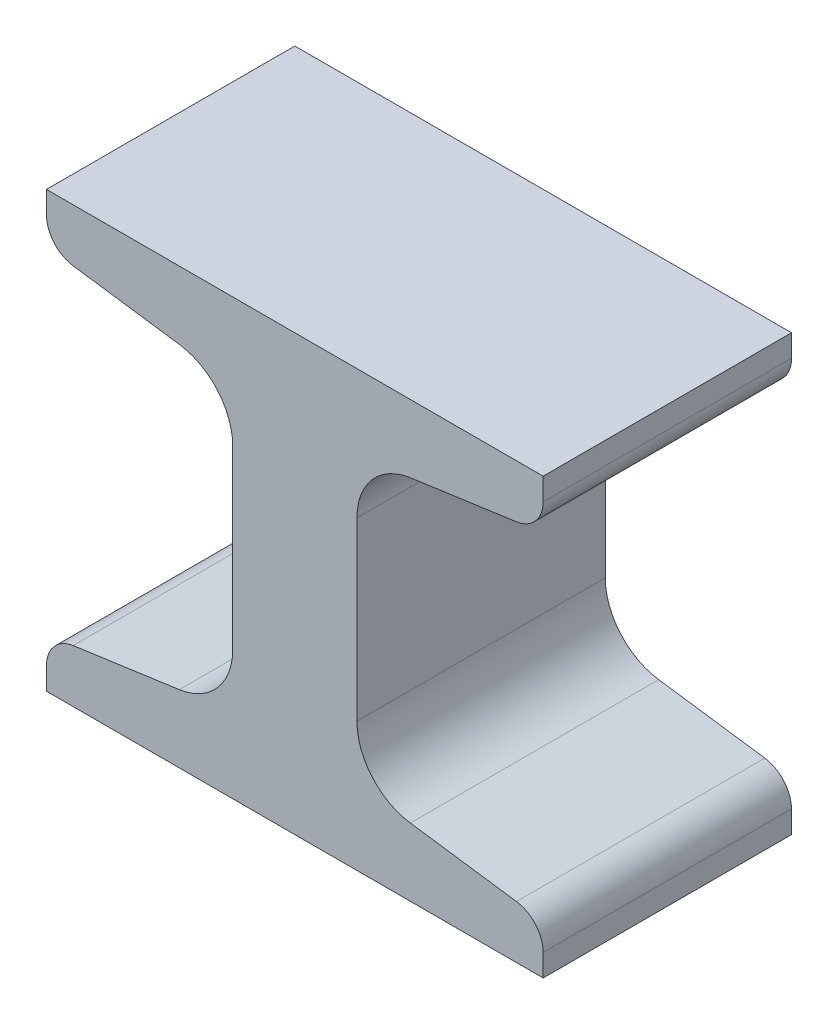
ISO-10303-21;
HEADER;
FILE_DESCRIPTION(('STEP AP214'),'2;1');
FILE_NAME('part.step','',(''),(''),'','','');
FILE_SCHEMA(('AUTOMOTIVE_DESIGN { 1 0 10303 214 1 1 1 1 }'));
ENDSEC;
DATA;
#1=APPLICATION_CONTEXT('core data for automotive mechanical design processes');
#2=APPLICATION_PROTOCOL_DEFINITION('international standard','automotive_design',2000,#1);
#3=PRODUCT_CONTEXT('',#1,'mechanical');
#4=PRODUCT('Part','Part','',(#3));
#5=PRODUCT_RELATED_PRODUCT_CATEGORY('part','',(#4));
#6=PRODUCT_DEFINITION_FORMATION('','',#4);
#7=PRODUCT_DEFINITION_CONTEXT('part definition',#1,'design');
#8=PRODUCT_DEFINITION('design','',#6,#7);
#9=PRODUCT_DEFINITION_SHAPE('','',#8);
#10=(LENGTH_UNIT() NAMED_UNIT(*) SI_UNIT(.MILLI.,.METRE.));
#11=(NAMED_UNIT(*) PLANE_ANGLE_UNIT() SI_UNIT($,.RADIAN.));
#12=(NAMED_UNIT(*) SI_UNIT($,.STERADIAN.) SOLID_ANGLE_UNIT());
#13=UNCERTAINTY_MEASURE_WITH_UNIT(LENGTH_MEASURE(1.E-05),#10,'distance_accuracy_value','');
#14=(GEOMETRIC_REPRESENTATION_CONTEXT(3) GLOBAL_UNCERTAINTY_ASSIGNED_CONTEXT((#13)) GLOBAL_UNIT_ASSIGNED_CONTEXT((#10,
#11,#12)) REPRESENTATION_CONTEXT('',''));
#15=CARTESIAN_POINT('',(0.,0.,0.));
#16=DIRECTION('',(0.,0.,1.));
#17=DIRECTION('',(1.,0.,0.));
#18=AXIS2_PLACEMENT_3D('',#15,#16,#17);
#19=CARTESIAN_POINT('',(50.8,-4.57140674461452E-13,12.7));
#20=DIRECTION('',(0.,-1.,0.));
#21=DIRECTION('',(1.,0.,0.));
#22=AXIS2_PLACEMENT_3D('',#19,#20,#21);
#23=PLANE('',#22);
#24=DIRECTION('',(-1.,0.,0.));
#25=VECTOR('',#24,1.);
#26=CARTESIAN_POINT('',(50.8,-4.57140674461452E-13,-12.7));
#27=LINE('',#26,#25);
#28=CARTESIAN_POINT('',(50.8,-4.57140674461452E-13,-12.7));
#29=VERTEX_POINT('',#28);
#30=CARTESIAN_POINT('',(0.,0.,-12.7));
#31=VERTEX_POINT('',#30);
#32=EDGE_CURVE('E233',#29,#31,#27,.T.);
#33=ORIENTED_EDGE('',*,*,#32,.F.);
#34=DIRECTION('',(0.,0.,-1.));
#35=VECTOR('',#34,1.);
#36=CARTESIAN_POINT('',(50.8,-4.57140674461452E-13,12.7));
#37=LINE('',#36,#35);
#38=CARTESIAN_POINT('',(50.8,-4.57140674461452E-13,12.7));
#39=VERTEX_POINT('',#38);
#40=EDGE_CURVE('E191',#39,#29,#37,.T.);
#41=ORIENTED_EDGE('',*,*,#40,.F.);
#42=DIRECTION('',(-1.,0.,0.));
#43=VECTOR('',#42,1.);
#44=CARTESIAN_POINT('',(50.8,-4.57140674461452E-13,12.7));
#45=LINE('',#44,#43);
#46=CARTESIAN_POINT('',(0.,0.,12.7));
#47=VERTEX_POINT('',#46);
#48=EDGE_CURVE('E186',#39,#47,#45,.T.);
#49=ORIENTED_EDGE('',*,*,#48,.T.);
#50=DIRECTION('',(0.,0.,-1.));
#51=VECTOR('',#50,1.);
#52=CARTESIAN_POINT('',(0.,0.,12.7));
#53=LINE('',#52,#51);
#54=EDGE_CURVE('E169',#47,#31,#53,.T.);
#55=ORIENTED_EDGE('',*,*,#54,.T.);
#56=EDGE_LOOP('',(#33,#41,#49,#55));
#57=FACE_BOUND('',#56,.T.);
#58=ADVANCED_FACE('F32',(#57),#23,.T.);
#59=CARTESIAN_POINT('',(50.8,5.02570129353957,12.7));
#60=DIRECTION('',(1.,0.,0.));
#61=DIRECTION('',(0.,0.,-1.));
#62=AXIS2_PLACEMENT_3D('',#59,#60,#61);
#63=PLANE('',#62);
#64=DIRECTION('',(0.,-1.,0.));
#65=VECTOR('',#64,1.);
#66=CARTESIAN_POINT('',(50.8,5.02570129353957,-12.7));
#67=LINE('',#66,#65);
#68=CARTESIAN_POINT('',(50.8,2.26571590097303,-12.7));
#69=VERTEX_POINT('',#68);
#70=EDGE_CURVE('E192',#69,#29,#67,.T.);
#71=ORIENTED_EDGE('',*,*,#70,.F.);
#72=DIRECTION('',(0.,0.,-1.));
#73=VECTOR('',#72,1.);
#74=CARTESIAN_POINT('',(50.8,2.26571590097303,12.7));
#75=LINE('',#74,#73);
#76=CARTESIAN_POINT('',(50.8,2.26571590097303,12.7));
#77=VERTEX_POINT('',#76);
#78=EDGE_CURVE('E305',#69,#77,#75,.F.);
#79=ORIENTED_EDGE('',*,*,#78,.T.);
#80=DIRECTION('',(0.,-1.,0.));
#81=VECTOR('',#80,1.);
#82=CARTESIAN_POINT('',(50.8,5.02570129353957,12.7));
#83=LINE('',#82,#81);
#84=EDGE_CURVE('E181',#77,#39,#83,.T.);
#85=ORIENTED_EDGE('',*,*,#84,.T.);
#86=ORIENTED_EDGE('',*,*,#40,.T.);
#87=EDGE_LOOP('',(#71,#79,#85,#86));
#88=FACE_BOUND('',#87,.T.);
#89=ADVANCED_FACE('F382',(#88),#63,.T.);
#90=CARTESIAN_POINT('',(37.2162508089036,6.93477274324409,12.7));
#91=DIRECTION('',(0.139173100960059,0.990268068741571,0.));
#92=DIRECTION('',(-0.990268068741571,0.139173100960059,0.));
#93=AXIS2_PLACEMENT_3D('',#90,#91,#92);
#94=PLANE('',#93);
#95=DIRECTION('',(0.990268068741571,-0.139173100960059,0.));
#96=VECTOR('',#95,1.);
#97=CARTESIAN_POINT('',(37.2162508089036,6.93477274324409,12.7));
#98=LINE('',#97,#96);
#99=CARTESIAN_POINT('',(37.2162508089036,6.93477274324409,12.7));
#100=VERTEX_POINT('',#99);
#101=CARTESIAN_POINT('',(48.0668745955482,5.40981701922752,12.7));
#102=VERTEX_POINT('',#101);
#103=EDGE_CURVE('E229',#100,#102,#98,.T.);
#104=ORIENTED_EDGE('',*,*,#103,.T.);
#105=DIRECTION('',(0.,0.,-1.));
#106=VECTOR('',#105,1.);
#107=CARTESIAN_POINT('',(48.0668745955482,5.40981701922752,12.7));
#108=LINE('',#107,#106);
#109=CARTESIAN_POINT('',(48.0668745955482,5.40981701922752,-12.7));
#110=VERTEX_POINT('',#109);
#111=EDGE_CURVE('E272',#102,#110,#108,.T.);
#112=ORIENTED_EDGE('',*,*,#111,.T.);
#113=DIRECTION('',(0.990268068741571,-0.139173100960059,0.));
#114=VECTOR('',#113,1.);
#115=CARTESIAN_POINT('',(37.2162508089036,6.93477274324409,-12.7));
#116=LINE('',#115,#114);
#117=CARTESIAN_POINT('',(37.2162508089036,6.93477274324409,-12.7));
#118=VERTEX_POINT('',#117);
#119=EDGE_CURVE('E194',#118,#110,#116,.T.);
#120=ORIENTED_EDGE('',*,*,#119,.F.);
#121=DIRECTION('',(0.,0.,-1.));
#122=VECTOR('',#121,1.);
#123=CARTESIAN_POINT('',(37.2162508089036,6.93477274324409,12.7));
#124=LINE('',#123,#122);
#125=EDGE_CURVE('E273',#100,#118,#124,.T.);
#126=ORIENTED_EDGE('',*,*,#125,.F.);
#127=EDGE_LOOP('',(#104,#112,#120,#126));
#128=FACE_BOUND('',#127,.T.);
#129=ADVANCED_FACE('F376',(#128),#94,.T.);
#130=CARTESIAN_POINT('',(38.1,13.2229749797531,12.7));
#131=DIRECTION('',(0.,0.,-1.));
#132=DIRECTION('',(-1.,0.,0.));
#133=AXIS2_PLACEMENT_3D('',#130,#131,#132);
#134=CYLINDRICAL_SURFACE('',#133,6.35);
#135=CARTESIAN_POINT('',(38.1,13.2229749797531,-12.7));
#136=DIRECTION('',(0.,0.,1.));
#137=DIRECTION('',(1.,0.,0.));
#138=AXIS2_PLACEMENT_3D('',#135,#136,#137);
#139=CIRCLE('',#138,6.35);
#140=CARTESIAN_POINT('',(31.75,13.2229749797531,-12.7));
#141=VERTEX_POINT('',#140);
#142=EDGE_CURVE('E266',#141,#118,#139,.T.);
#143=ORIENTED_EDGE('',*,*,#142,.F.);
#144=DIRECTION('',(0.,0.,-1.));
#145=VECTOR('',#144,1.);
#146=CARTESIAN_POINT('',(31.75,13.2229749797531,12.7));
#147=LINE('',#146,#145);
#148=CARTESIAN_POINT('',(31.75,13.2229749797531,12.7));
#149=VERTEX_POINT('',#148);
#150=EDGE_CURVE('E275',#149,#141,#147,.T.);
#151=ORIENTED_EDGE('',*,*,#150,.F.);
#152=CARTESIAN_POINT('',(38.1,13.2229749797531,12.7));
#153=DIRECTION('',(0.,0.,1.));
#154=DIRECTION('',(1.,0.,0.));
#155=AXIS2_PLACEMENT_3D('',#152,#153,#154);
#156=CIRCLE('',#155,6.35);
#157=EDGE_CURVE('E226',#149,#100,#156,.T.);
#158=ORIENTED_EDGE('',*,*,#157,.T.);
#159=ORIENTED_EDGE('',*,*,#125,.T.);
#160=EDGE_LOOP('',(#143,#151,#158,#159));
#161=FACE_BOUND('',#160,.T.);
#162=ADVANCED_FACE('F372',(#161),#134,.F.);
#163=CARTESIAN_POINT('',(31.75,31.227025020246,12.7));
#164=DIRECTION('',(1.,0.,0.));
#165=DIRECTION('',(0.,1.,0.));
#166=AXIS2_PLACEMENT_3D('',#163,#164,#165);
#167=PLANE('',#166);
#168=DIRECTION('',(0.,-1.,0.));
#169=VECTOR('',#168,1.);
#170=CARTESIAN_POINT('',(31.75,31.227025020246,-12.7));
#171=LINE('',#170,#169);
#172=CARTESIAN_POINT('',(31.75,31.227025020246,-12.7));
#173=VERTEX_POINT('',#172);
#174=EDGE_CURVE('E263',#173,#141,#171,.T.);
#175=ORIENTED_EDGE('',*,*,#174,.F.);
#176=DIRECTION('',(0.,0.,-1.));
#177=VECTOR('',#176,1.);
#178=CARTESIAN_POINT('',(31.75,31.227025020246,12.7));
#179=LINE('',#178,#177);
#180=CARTESIAN_POINT('',(31.75,31.227025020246,12.7));
#181=VERTEX_POINT('',#180);
#182=EDGE_CURVE('E277',#181,#173,#179,.T.);
#183=ORIENTED_EDGE('',*,*,#182,.F.);
#184=DIRECTION('',(0.,-1.,0.));
#185=VECTOR('',#184,1.);
#186=CARTESIAN_POINT('',(31.75,31.227025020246,12.7));
#187=LINE('',#186,#185);
#188=EDGE_CURVE('E223',#181,#149,#187,.T.);
#189=ORIENTED_EDGE('',*,*,#188,.T.);
#190=ORIENTED_EDGE('',*,*,#150,.T.);
#191=EDGE_LOOP('',(#175,#183,#189,#190));
#192=FACE_BOUND('',#191,.T.);
#193=ADVANCED_FACE('F368',(#192),#167,.T.);
#194=CARTESIAN_POINT('',(38.1,31.227025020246,12.7));
#195=DIRECTION('',(0.,0.,-1.));
#196=DIRECTION('',(-1.,0.,0.));
#197=AXIS2_PLACEMENT_3D('',#194,#195,#196);
#198=CYLINDRICAL_SURFACE('',#197,6.35);
#199=CARTESIAN_POINT('',(38.1,31.227025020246,-12.7));
#200=DIRECTION('',(0.,0.,1.));
#201=DIRECTION('',(1.,0.,0.));
#202=AXIS2_PLACEMENT_3D('',#199,#200,#201);
#203=CIRCLE('',#202,6.35);
#204=CARTESIAN_POINT('',(37.2162508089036,37.515227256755,-12.7));
#205=VERTEX_POINT('',#204);
#206=EDGE_CURVE('E260',#205,#173,#203,.T.);
#207=ORIENTED_EDGE('',*,*,#206,.F.);
#208=DIRECTION('',(0.,0.,-1.));
#209=VECTOR('',#208,1.);
#210=CARTESIAN_POINT('',(37.2162508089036,37.515227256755,12.7));
#211=LINE('',#210,#209);
#212=CARTESIAN_POINT('',(37.2162508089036,37.515227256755,12.7));
#213=VERTEX_POINT('',#212);
#214=EDGE_CURVE('E279',#213,#205,#211,.T.);
#215=ORIENTED_EDGE('',*,*,#214,.F.);
#216=CARTESIAN_POINT('',(38.1,31.227025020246,12.7));
#217=DIRECTION('',(0.,0.,1.));
#218=DIRECTION('',(1.,0.,0.));
#219=AXIS2_PLACEMENT_3D('',#216,#217,#218);
#220=CIRCLE('',#219,6.35);
#221=EDGE_CURVE('E220',#213,#181,#220,.T.);
#222=ORIENTED_EDGE('',*,*,#221,.T.);
#223=ORIENTED_EDGE('',*,*,#182,.T.);
#224=EDGE_LOOP('',(#207,#215,#222,#223));
#225=FACE_BOUND('',#224,.T.);
#226=ADVANCED_FACE('F364',(#225),#198,.F.);
#227=CARTESIAN_POINT('',(50.8,39.4242987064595,12.7));
#228=DIRECTION('',(0.139173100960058,-0.990268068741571,0.));
#229=DIRECTION('',(0.990268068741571,0.139173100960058,0.));
#230=AXIS2_PLACEMENT_3D('',#227,#228,#229);
#231=PLANE('',#230);
#232=DIRECTION('',(-0.990268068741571,-0.139173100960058,0.));
#233=VECTOR('',#232,1.);
#234=CARTESIAN_POINT('',(50.8,39.4242987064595,-12.7));
#235=LINE('',#234,#233);
#236=CARTESIAN_POINT('',(48.0668745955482,39.0401829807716,-12.7));
#237=VERTEX_POINT('',#236);
#238=EDGE_CURVE('E258',#237,#205,#235,.T.);
#239=ORIENTED_EDGE('',*,*,#238,.F.);
#240=DIRECTION('',(0.,0.,-1.));
#241=VECTOR('',#240,1.);
#242=CARTESIAN_POINT('',(48.0668745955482,39.0401829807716,12.7));
#243=LINE('',#242,#241);
#244=CARTESIAN_POINT('',(48.0668745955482,39.0401829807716,12.7));
#245=VERTEX_POINT('',#244);
#246=EDGE_CURVE('E320',#237,#245,#243,.F.);
#247=ORIENTED_EDGE('',*,*,#246,.T.);
#248=DIRECTION('',(-0.990268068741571,-0.139173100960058,0.));
#249=VECTOR('',#248,1.);
#250=CARTESIAN_POINT('',(50.8,39.4242987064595,12.7));
#251=LINE('',#250,#249);
#252=EDGE_CURVE('E218',#245,#213,#251,.T.);
#253=ORIENTED_EDGE('',*,*,#252,.T.);
#254=ORIENTED_EDGE('',*,*,#214,.T.);
#255=EDGE_LOOP('',(#239,#247,#253,#254));
#256=FACE_BOUND('',#255,.T.);
#257=ADVANCED_FACE('F358',(#256),#231,.T.);
#258=CARTESIAN_POINT('',(50.8,44.4499999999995,12.7));
#259=DIRECTION('',(1.,0.,0.));
#260=DIRECTION('',(0.,1.,0.));
#261=AXIS2_PLACEMENT_3D('',#258,#259,#260);
#262=PLANE('',#261);
#263=DIRECTION('',(0.,-1.,0.));
#264=VECTOR('',#263,1.);
#265=CARTESIAN_POINT('',(50.8,44.4499999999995,12.7));
#266=LINE('',#265,#264);
#267=CARTESIAN_POINT('',(50.8,44.4499999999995,12.7));
#268=VERTEX_POINT('',#267);
#269=CARTESIAN_POINT('',(50.8,42.1842840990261,12.7));
#270=VERTEX_POINT('',#269);
#271=EDGE_CURVE('E215',#268,#270,#266,.T.);
#272=ORIENTED_EDGE('',*,*,#271,.T.);
#273=DIRECTION('',(0.,0.,-1.));
#274=VECTOR('',#273,1.);
#275=CARTESIAN_POINT('',(50.8,42.1842840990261,12.7));
#276=LINE('',#275,#274);
#277=CARTESIAN_POINT('',(50.8,42.1842840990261,-12.7));
#278=VERTEX_POINT('',#277);
#279=EDGE_CURVE('E317',#270,#278,#276,.T.);
#280=ORIENTED_EDGE('',*,*,#279,.T.);
#281=DIRECTION('',(0.,-1.,0.));
#282=VECTOR('',#281,1.);
#283=CARTESIAN_POINT('',(50.8,44.4499999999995,-12.7));
#284=LINE('',#283,#282);
#285=CARTESIAN_POINT('',(50.8,44.4499999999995,-12.7));
#286=VERTEX_POINT('',#285);
#287=EDGE_CURVE('E255',#286,#278,#284,.T.);
#288=ORIENTED_EDGE('',*,*,#287,.F.);
#289=DIRECTION('',(0.,0.,-1.));
#290=VECTOR('',#289,1.);
#291=CARTESIAN_POINT('',(50.8,44.4499999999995,12.7));
#292=LINE('',#291,#290);
#293=EDGE_CURVE('E282',#268,#286,#292,.T.);
#294=ORIENTED_EDGE('',*,*,#293,.F.);
#295=EDGE_LOOP('',(#272,#280,#288,#294));
#296=FACE_BOUND('',#295,.T.);
#297=ADVANCED_FACE('F350',(#296),#262,.T.);
#298=CARTESIAN_POINT('',(0.,44.4499999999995,12.7));
#299=DIRECTION('',(0.,1.,0.));
#300=DIRECTION('',(0.,0.,1.));
#301=AXIS2_PLACEMENT_3D('',#298,#299,#300);
#302=PLANE('',#301);
#303=DIRECTION('',(1.,0.,0.));
#304=VECTOR('',#303,1.);
#305=CARTESIAN_POINT('',(0.,44.4499999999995,-12.7));
#306=LINE('',#305,#304);
#307=CARTESIAN_POINT('',(0.,44.4499999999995,-12.7));
#308=VERTEX_POINT('',#307);
#309=EDGE_CURVE('E252',#308,#286,#306,.T.);
#310=ORIENTED_EDGE('',*,*,#309,.F.);
#311=DIRECTION('',(0.,0.,-1.));
#312=VECTOR('',#311,1.);
#313=CARTESIAN_POINT('',(0.,44.4499999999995,12.7));
#314=LINE('',#313,#312);
#315=CARTESIAN_POINT('',(0.,44.4499999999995,12.7));
#316=VERTEX_POINT('',#315);
#317=EDGE_CURVE('E284',#316,#308,#314,.T.);
#318=ORIENTED_EDGE('',*,*,#317,.F.);
#319=DIRECTION('',(1.,0.,0.));
#320=VECTOR('',#319,1.);
#321=CARTESIAN_POINT('',(0.,44.4499999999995,12.7));
#322=LINE('',#321,#320);
#323=EDGE_CURVE('E212',#316,#268,#322,.T.);
#324=ORIENTED_EDGE('',*,*,#323,.T.);
#325=ORIENTED_EDGE('',*,*,#293,.T.);
#326=EDGE_LOOP('',(#310,#318,#324,#325));
#327=FACE_BOUND('',#326,.T.);
#328=ADVANCED_FACE('F347',(#327),#302,.T.);
#329=CARTESIAN_POINT('',(0.,39.4242987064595,12.7));
#330=DIRECTION('',(-1.,0.,0.));
#331=DIRECTION('',(0.,-1.,0.));
#332=AXIS2_PLACEMENT_3D('',#329,#330,#331);
#333=PLANE('',#332);
#334=DIRECTION('',(0.,1.,0.));
#335=VECTOR('',#334,1.);
#336=CARTESIAN_POINT('',(0.,39.4242987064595,-12.7));
#337=LINE('',#336,#335);
#338=CARTESIAN_POINT('',(0.,42.184284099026,-12.7));
#339=VERTEX_POINT('',#338);
#340=EDGE_CURVE('E250',#339,#308,#337,.T.);
#341=ORIENTED_EDGE('',*,*,#340,.F.);
#342=DIRECTION('',(0.,0.,-1.));
#343=VECTOR('',#342,1.);
#344=CARTESIAN_POINT('',(0.,42.184284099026,12.7));
#345=LINE('',#344,#343);
#346=CARTESIAN_POINT('',(0.,42.184284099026,12.7));
#347=VERTEX_POINT('',#346);
#348=EDGE_CURVE('E11',#339,#347,#345,.F.);
#349=ORIENTED_EDGE('',*,*,#348,.T.);
#350=DIRECTION('',(0.,1.,0.));
#351=VECTOR('',#350,1.);
#352=CARTESIAN_POINT('',(0.,39.4242987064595,12.7));
#353=LINE('',#352,#351);
#354=EDGE_CURVE('E210',#347,#316,#353,.T.);
#355=ORIENTED_EDGE('',*,*,#354,.T.);
#356=ORIENTED_EDGE('',*,*,#317,.T.);
#357=EDGE_LOOP('',(#341,#349,#355,#356));
#358=FACE_BOUND('',#357,.T.);
#359=ADVANCED_FACE('F342',(#358),#333,.T.);
#360=CARTESIAN_POINT('',(13.5837491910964,37.515227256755,12.7));
#361=DIRECTION('',(-0.139173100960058,-0.990268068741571,0.));
#362=DIRECTION('',(0.990268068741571,-0.139173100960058,0.));
#363=AXIS2_PLACEMENT_3D('',#360,#361,#362);
#364=PLANE('',#363);
#365=DIRECTION('',(-0.990268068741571,0.139173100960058,0.));
#366=VECTOR('',#365,1.);
#367=CARTESIAN_POINT('',(13.5837491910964,37.515227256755,12.7));
#368=LINE('',#367,#366);
#369=CARTESIAN_POINT('',(13.5837491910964,37.515227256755,12.7));
#370=VERTEX_POINT('',#369);
#371=CARTESIAN_POINT('',(2.7331254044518,39.0401829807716,12.7));
#372=VERTEX_POINT('',#371);
#373=EDGE_CURVE('E207',#370,#372,#368,.T.);
#374=ORIENTED_EDGE('',*,*,#373,.T.);
#375=DIRECTION('',(0.,0.,-1.));
#376=VECTOR('',#375,1.);
#377=CARTESIAN_POINT('',(2.7331254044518,39.0401829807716,12.7));
#378=LINE('',#377,#376);
#379=CARTESIAN_POINT('',(2.7331254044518,39.0401829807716,-12.7));
#380=VERTEX_POINT('',#379);
#381=EDGE_CURVE('E40',#372,#380,#378,.T.);
#382=ORIENTED_EDGE('',*,*,#381,.T.);
#383=DIRECTION('',(-0.990268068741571,0.139173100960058,0.));
#384=VECTOR('',#383,1.);
#385=CARTESIAN_POINT('',(13.5837491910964,37.515227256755,-12.7));
#386=LINE('',#385,#384);
#387=CARTESIAN_POINT('',(13.5837491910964,37.515227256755,-12.7));
#388=VERTEX_POINT('',#387);
#389=EDGE_CURVE('E247',#388,#380,#386,.T.);
#390=ORIENTED_EDGE('',*,*,#389,.F.);
#391=DIRECTION('',(0.,0.,-1.));
#392=VECTOR('',#391,1.);
#393=CARTESIAN_POINT('',(13.5837491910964,37.515227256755,12.7));
#394=LINE('',#393,#392);
#395=EDGE_CURVE('E287',#370,#388,#394,.T.);
#396=ORIENTED_EDGE('',*,*,#395,.F.);
#397=EDGE_LOOP('',(#374,#382,#390,#396));
#398=FACE_BOUND('',#397,.T.);
#399=ADVANCED_FACE('F325',(#398),#364,.T.);
#400=CARTESIAN_POINT('',(12.7,31.227025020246,12.7));
#401=DIRECTION('',(0.,0.,-1.));
#402=DIRECTION('',(-1.,0.,0.));
#403=AXIS2_PLACEMENT_3D('',#400,#401,#402);
#404=CYLINDRICAL_SURFACE('',#403,6.34999999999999);
#405=CARTESIAN_POINT('',(12.7,31.227025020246,-12.7));
#406=DIRECTION('',(0.,0.,1.));
#407=DIRECTION('',(1.,0.,0.));
#408=AXIS2_PLACEMENT_3D('',#405,#406,#407);
#409=CIRCLE('',#408,6.34999999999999);
#410=CARTESIAN_POINT('',(19.05,31.227025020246,-12.7));
#411=VERTEX_POINT('',#410);
#412=EDGE_CURVE('E244',#411,#388,#409,.T.);
#413=ORIENTED_EDGE('',*,*,#412,.F.);
#414=DIRECTION('',(0.,0.,-1.));
#415=VECTOR('',#414,1.);
#416=CARTESIAN_POINT('',(19.05,31.227025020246,12.7));
#417=LINE('',#416,#415);
#418=CARTESIAN_POINT('',(19.05,31.227025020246,12.7));
#419=VERTEX_POINT('',#418);
#420=EDGE_CURVE('E289',#419,#411,#417,.T.);
#421=ORIENTED_EDGE('',*,*,#420,.F.);
#422=CARTESIAN_POINT('',(12.7,31.227025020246,12.7));
#423=DIRECTION('',(0.,0.,1.));
#424=DIRECTION('',(1.,0.,0.));
#425=AXIS2_PLACEMENT_3D('',#422,#423,#424);
#426=CIRCLE('',#425,6.34999999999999);
#427=EDGE_CURVE('E204',#419,#370,#426,.T.);
#428=ORIENTED_EDGE('',*,*,#427,.T.);
#429=ORIENTED_EDGE('',*,*,#395,.T.);
#430=EDGE_LOOP('',(#413,#421,#428,#429));
#431=FACE_BOUND('',#430,.T.);
#432=ADVANCED_FACE('F335',(#431),#404,.F.);
#433=CARTESIAN_POINT('',(19.05,13.2229749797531,12.7));
#434=DIRECTION('',(-1.,0.,0.));
#435=DIRECTION('',(0.,-1.,0.));
#436=AXIS2_PLACEMENT_3D('',#433,#434,#435);
#437=PLANE('',#436);
#438=DIRECTION('',(0.,1.,0.));
#439=VECTOR('',#438,1.);
#440=CARTESIAN_POINT('',(19.05,13.2229749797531,-12.7));
#441=LINE('',#440,#439);
#442=CARTESIAN_POINT('',(19.05,13.2229749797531,-12.7));
#443=VERTEX_POINT('',#442);
#444=EDGE_CURVE('E241',#443,#411,#441,.T.);
#445=ORIENTED_EDGE('',*,*,#444,.F.);
#446=DIRECTION('',(0.,0.,-1.));
#447=VECTOR('',#446,1.);
#448=CARTESIAN_POINT('',(19.05,13.2229749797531,12.7));
#449=LINE('',#448,#447);
#450=CARTESIAN_POINT('',(19.05,13.2229749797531,12.7));
#451=VERTEX_POINT('',#450);
#452=EDGE_CURVE('E291',#451,#443,#449,.T.);
#453=ORIENTED_EDGE('',*,*,#452,.F.);
#454=DIRECTION('',(0.,1.,0.));
#455=VECTOR('',#454,1.);
#456=CARTESIAN_POINT('',(19.05,13.2229749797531,12.7));
#457=LINE('',#456,#455);
#458=EDGE_CURVE('E201',#451,#419,#457,.T.);
#459=ORIENTED_EDGE('',*,*,#458,.T.);
#460=ORIENTED_EDGE('',*,*,#420,.T.);
#461=EDGE_LOOP('',(#445,#453,#459,#460));
#462=FACE_BOUND('',#461,.T.);
#463=ADVANCED_FACE('F410',(#462),#437,.T.);
#464=CARTESIAN_POINT('',(12.7,13.2229749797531,12.7));
#465=DIRECTION('',(0.,0.,-1.));
#466=DIRECTION('',(-1.,0.,0.));
#467=AXIS2_PLACEMENT_3D('',#464,#465,#466);
#468=CYLINDRICAL_SURFACE('',#467,6.35);
#469=CARTESIAN_POINT('',(12.7,13.2229749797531,-12.7));
#470=DIRECTION('',(0.,0.,1.));
#471=DIRECTION('',(1.,0.,0.));
#472=AXIS2_PLACEMENT_3D('',#469,#470,#471);
#473=CIRCLE('',#472,6.35);
#474=CARTESIAN_POINT('',(13.5837491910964,6.93477274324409,-12.7));
#475=VERTEX_POINT('',#474);
#476=EDGE_CURVE('E238',#475,#443,#473,.T.);
#477=ORIENTED_EDGE('',*,*,#476,.F.);
#478=DIRECTION('',(0.,0.,-1.));
#479=VECTOR('',#478,1.);
#480=CARTESIAN_POINT('',(13.5837491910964,6.93477274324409,12.7));
#481=LINE('',#480,#479);
#482=CARTESIAN_POINT('',(13.5837491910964,6.93477274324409,12.7));
#483=VERTEX_POINT('',#482);
#484=EDGE_CURVE('E180',#483,#475,#481,.T.);
#485=ORIENTED_EDGE('',*,*,#484,.F.);
#486=CARTESIAN_POINT('',(12.7,13.2229749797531,12.7));
#487=DIRECTION('',(0.,0.,1.));
#488=DIRECTION('',(1.,0.,0.));
#489=AXIS2_PLACEMENT_3D('',#486,#487,#488);
#490=CIRCLE('',#489,6.35);
#491=EDGE_CURVE('E198',#483,#451,#490,.T.);
#492=ORIENTED_EDGE('',*,*,#491,.T.);
#493=ORIENTED_EDGE('',*,*,#452,.T.);
#494=EDGE_LOOP('',(#477,#485,#492,#493));
#495=FACE_BOUND('',#494,.T.);
#496=ADVANCED_FACE('F407',(#495),#468,.F.);
#497=CARTESIAN_POINT('',(0.,5.02570129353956,12.7));
#498=DIRECTION('',(-0.139173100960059,0.990268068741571,0.));
#499=DIRECTION('',(-0.990268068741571,-0.139173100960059,0.));
#500=AXIS2_PLACEMENT_3D('',#497,#498,#499);
#501=PLANE('',#500);
#502=DIRECTION('',(0.990268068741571,0.139173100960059,0.));
#503=VECTOR('',#502,1.);
#504=CARTESIAN_POINT('',(0.,5.02570129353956,-12.7));
#505=LINE('',#504,#503);
#506=CARTESIAN_POINT('',(2.73312540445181,5.40981701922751,-12.7));
#507=VERTEX_POINT('',#506);
#508=EDGE_CURVE('E236',#507,#475,#505,.T.);
#509=ORIENTED_EDGE('',*,*,#508,.F.);
#510=DIRECTION('',(0.,0.,-1.));
#511=VECTOR('',#510,1.);
#512=CARTESIAN_POINT('',(2.73312540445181,5.40981701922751,12.7));
#513=LINE('',#512,#511);
#514=CARTESIAN_POINT('',(2.73312540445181,5.40981701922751,12.7));
#515=VERTEX_POINT('',#514);
#516=EDGE_CURVE('E55',#507,#515,#513,.F.);
#517=ORIENTED_EDGE('',*,*,#516,.T.);
#518=DIRECTION('',(0.990268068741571,0.139173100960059,0.));
#519=VECTOR('',#518,1.);
#520=CARTESIAN_POINT('',(0.,5.02570129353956,12.7));
#521=LINE('',#520,#519);
#522=EDGE_CURVE('E187',#515,#483,#521,.T.);
#523=ORIENTED_EDGE('',*,*,#522,.T.);
#524=ORIENTED_EDGE('',*,*,#484,.T.);
#525=EDGE_LOOP('',(#509,#517,#523,#524));
#526=FACE_BOUND('',#525,.T.);
#527=ADVANCED_FACE('F404',(#526),#501,.T.);
#528=CARTESIAN_POINT('',(0.,0.,12.7));
#529=DIRECTION('',(-1.,0.,0.));
#530=DIRECTION('',(0.,-1.,0.));
#531=AXIS2_PLACEMENT_3D('',#528,#529,#530);
#532=PLANE('',#531);
#533=DIRECTION('',(0.,1.,0.));
#534=VECTOR('',#533,1.);
#535=CARTESIAN_POINT('',(0.,0.,12.7));
#536=LINE('',#535,#534);
#537=CARTESIAN_POINT('',(0.,2.26571590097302,12.7));
#538=VERTEX_POINT('',#537);
#539=EDGE_CURVE('E172',#47,#538,#536,.T.);
#540=ORIENTED_EDGE('',*,*,#539,.T.);
#541=DIRECTION('',(0.,0.,-1.));
#542=VECTOR('',#541,1.);
#543=CARTESIAN_POINT('',(0.,2.26571590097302,12.7));
#544=LINE('',#543,#542);
#545=CARTESIAN_POINT('',(0.,2.26571590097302,-12.7));
#546=VERTEX_POINT('',#545);
#547=EDGE_CURVE('E314',#538,#546,#544,.T.);
#548=ORIENTED_EDGE('',*,*,#547,.T.);
#549=DIRECTION('',(0.,1.,0.));
#550=VECTOR('',#549,1.);
#551=CARTESIAN_POINT('',(0.,0.,-12.7));
#552=LINE('',#551,#550);
#553=EDGE_CURVE('E175',#31,#546,#552,.T.);
#554=ORIENTED_EDGE('',*,*,#553,.F.);
#555=ORIENTED_EDGE('',*,*,#54,.F.);
#556=EDGE_LOOP('',(#540,#548,#554,#555));
#557=FACE_BOUND('',#556,.T.);
#558=ADVANCED_FACE('F170',(#557),#532,.T.);
#559=CARTESIAN_POINT('',(12.7,13.2229749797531,12.7));
#560=DIRECTION('',(0.,0.,1.));
#561=DIRECTION('',(1.,0.,0.));
#562=AXIS2_PLACEMENT_3D('',#559,#560,#561);
#563=PLANE('',#562);
#564=ORIENTED_EDGE('',*,*,#84,.F.);
#565=CARTESIAN_POINT('',(47.625,2.26571590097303,12.7));
#566=DIRECTION('',(0.,0.,1.));
#567=DIRECTION('',(1.,0.,0.));
#568=AXIS2_PLACEMENT_3D('',#565,#566,#567);
#569=CIRCLE('',#568,3.175);
#570=EDGE_CURVE('E312',#77,#102,#569,.T.);
#571=ORIENTED_EDGE('',*,*,#570,.T.);
#572=ORIENTED_EDGE('',*,*,#103,.F.);
#573=ORIENTED_EDGE('',*,*,#157,.F.);
#574=ORIENTED_EDGE('',*,*,#188,.F.);
#575=ORIENTED_EDGE('',*,*,#221,.F.);
#576=ORIENTED_EDGE('',*,*,#252,.F.);
#577=CARTESIAN_POINT('',(47.625,42.1842840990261,12.7));
#578=DIRECTION('',(0.,0.,1.));
#579=DIRECTION('',(1.,0.,0.));
#580=AXIS2_PLACEMENT_3D('',#577,#578,#579);
#581=CIRCLE('',#580,3.175);
#582=EDGE_CURVE('E309',#245,#270,#581,.T.);
#583=ORIENTED_EDGE('',*,*,#582,.T.);
#584=ORIENTED_EDGE('',*,*,#271,.F.);
#585=ORIENTED_EDGE('',*,*,#323,.F.);
#586=ORIENTED_EDGE('',*,*,#354,.F.);
#587=CARTESIAN_POINT('',(3.17499999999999,42.184284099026,12.7));
#588=DIRECTION('',(0.,0.,1.));
#589=DIRECTION('',(1.,0.,0.));
#590=AXIS2_PLACEMENT_3D('',#587,#588,#589);
#591=CIRCLE('',#590,3.175);
#592=EDGE_CURVE('E307',#347,#372,#591,.T.);
#593=ORIENTED_EDGE('',*,*,#592,.T.);
#594=ORIENTED_EDGE('',*,*,#373,.F.);
#595=ORIENTED_EDGE('',*,*,#427,.F.);
#596=ORIENTED_EDGE('',*,*,#458,.F.);
#597=ORIENTED_EDGE('',*,*,#491,.F.);
#598=ORIENTED_EDGE('',*,*,#522,.F.);
#599=CARTESIAN_POINT('',(3.175,2.26571590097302,12.7));
#600=DIRECTION('',(0.,0.,1.));
#601=DIRECTION('',(1.,0.,0.));
#602=AXIS2_PLACEMENT_3D('',#599,#600,#601);
#603=CIRCLE('',#602,3.175);
#604=EDGE_CURVE('E47',#515,#538,#603,.T.);
#605=ORIENTED_EDGE('',*,*,#604,.T.);
#606=ORIENTED_EDGE('',*,*,#539,.F.);
#607=ORIENTED_EDGE('',*,*,#48,.F.);
#608=EDGE_LOOP('',(#564,#571,#572,#573,#574,#575,#576,#583,#584,#585,#586,#593,#594,#595,#596,
#597,#598,#605,#606,#607));
#609=FACE_BOUND('',#608,.T.);
#610=ADVANCED_FACE('F185',(#609),#563,.T.);
#611=CARTESIAN_POINT('',(12.7,13.2229749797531,-12.7));
#612=DIRECTION('',(0.,0.,1.));
#613=DIRECTION('',(1.,0.,0.));
#614=AXIS2_PLACEMENT_3D('',#611,#612,#613);
#615=PLANE('',#614);
#616=ORIENTED_EDGE('',*,*,#119,.T.);
#617=CARTESIAN_POINT('',(47.625,2.26571590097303,-12.7));
#618=DIRECTION('',(0.,0.,1.));
#619=DIRECTION('',(1.,0.,0.));
#620=AXIS2_PLACEMENT_3D('',#617,#618,#619);
#621=CIRCLE('',#620,3.175);
#622=EDGE_CURVE('E303',#110,#69,#621,.F.);
#623=ORIENTED_EDGE('',*,*,#622,.T.);
#624=ORIENTED_EDGE('',*,*,#70,.T.);
#625=ORIENTED_EDGE('',*,*,#32,.T.);
#626=ORIENTED_EDGE('',*,*,#553,.T.);
#627=CARTESIAN_POINT('',(3.175,2.26571590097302,-12.7));
#628=DIRECTION('',(0.,0.,1.));
#629=DIRECTION('',(1.,0.,0.));
#630=AXIS2_PLACEMENT_3D('',#627,#628,#629);
#631=CIRCLE('',#630,3.175);
#632=EDGE_CURVE('E301',#546,#507,#631,.F.);
#633=ORIENTED_EDGE('',*,*,#632,.T.);
#634=ORIENTED_EDGE('',*,*,#508,.T.);
#635=ORIENTED_EDGE('',*,*,#476,.T.);
#636=ORIENTED_EDGE('',*,*,#444,.T.);
#637=ORIENTED_EDGE('',*,*,#412,.T.);
#638=ORIENTED_EDGE('',*,*,#389,.T.);
#639=CARTESIAN_POINT('',(3.17499999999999,42.184284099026,-12.7));
#640=DIRECTION('',(0.,0.,1.));
#641=DIRECTION('',(1.,0.,0.));
#642=AXIS2_PLACEMENT_3D('',#639,#640,#641);
#643=CIRCLE('',#642,3.175);
#644=EDGE_CURVE('E297',#380,#339,#643,.F.);
#645=ORIENTED_EDGE('',*,*,#644,.T.);
#646=ORIENTED_EDGE('',*,*,#340,.T.);
#647=ORIENTED_EDGE('',*,*,#309,.T.);
#648=ORIENTED_EDGE('',*,*,#287,.T.);
#649=CARTESIAN_POINT('',(47.625,42.1842840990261,-12.7));
#650=DIRECTION('',(0.,0.,1.));
#651=DIRECTION('',(1.,0.,0.));
#652=AXIS2_PLACEMENT_3D('',#649,#650,#651);
#653=CIRCLE('',#652,3.175);
#654=EDGE_CURVE('E299',#278,#237,#653,.F.);
#655=ORIENTED_EDGE('',*,*,#654,.T.);
#656=ORIENTED_EDGE('',*,*,#238,.T.);
#657=ORIENTED_EDGE('',*,*,#206,.T.);
#658=ORIENTED_EDGE('',*,*,#174,.T.);
#659=ORIENTED_EDGE('',*,*,#142,.T.);
#660=EDGE_LOOP('',(#616,#623,#624,#625,#626,#633,#634,#635,#636,#637,#638,#645,#646,#647,#648,
#655,#656,#657,#658,#659));
#661=FACE_BOUND('',#660,.T.);
#662=ADVANCED_FACE('F330',(#661),#615,.F.);
#663=CARTESIAN_POINT('',(47.625,2.26571590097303,12.7));
#664=DIRECTION('',(0.,0.,-1.));
#665=DIRECTION('',(-1.,0.,0.));
#666=AXIS2_PLACEMENT_3D('',#663,#664,#665);
#667=CYLINDRICAL_SURFACE('',#666,3.175);
#668=ORIENTED_EDGE('',*,*,#570,.F.);
#669=ORIENTED_EDGE('',*,*,#78,.F.);
#670=ORIENTED_EDGE('',*,*,#622,.F.);
#671=ORIENTED_EDGE('',*,*,#111,.F.);
#672=EDGE_LOOP('',(#668,#669,#670,#671));
#673=FACE_BOUND('',#672,.T.);
#674=ADVANCED_FACE('F384',(#673),#667,.T.);
#675=CARTESIAN_POINT('',(3.175,2.26571590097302,12.7));
#676=DIRECTION('',(0.,0.,-1.));
#677=DIRECTION('',(-1.,0.,0.));
#678=AXIS2_PLACEMENT_3D('',#675,#676,#677);
#679=CYLINDRICAL_SURFACE('',#678,3.175);
#680=ORIENTED_EDGE('',*,*,#604,.F.);
#681=ORIENTED_EDGE('',*,*,#516,.F.);
#682=ORIENTED_EDGE('',*,*,#632,.F.);
#683=ORIENTED_EDGE('',*,*,#547,.F.);
#684=EDGE_LOOP('',(#680,#681,#682,#683));
#685=FACE_BOUND('',#684,.T.);
#686=ADVANCED_FACE('F386',(#685),#679,.T.);
#687=CARTESIAN_POINT('',(47.625,42.1842840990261,12.7));
#688=DIRECTION('',(0.,0.,-1.));
#689=DIRECTION('',(-1.,0.,0.));
#690=AXIS2_PLACEMENT_3D('',#687,#688,#689);
#691=CYLINDRICAL_SURFACE('',#690,3.175);
#692=ORIENTED_EDGE('',*,*,#582,.F.);
#693=ORIENTED_EDGE('',*,*,#246,.F.);
#694=ORIENTED_EDGE('',*,*,#654,.F.);
#695=ORIENTED_EDGE('',*,*,#279,.F.);
#696=EDGE_LOOP('',(#692,#693,#694,#695));
#697=FACE_BOUND('',#696,.T.);
#698=ADVANCED_FACE('F354',(#697),#691,.T.);
#699=CARTESIAN_POINT('',(3.17499999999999,42.184284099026,12.7));
#700=DIRECTION('',(0.,0.,-1.));
#701=DIRECTION('',(-1.,0.,0.));
#702=AXIS2_PLACEMENT_3D('',#699,#700,#701);
#703=CYLINDRICAL_SURFACE('',#702,3.175);
#704=ORIENTED_EDGE('',*,*,#592,.F.);
#705=ORIENTED_EDGE('',*,*,#348,.F.);
#706=ORIENTED_EDGE('',*,*,#644,.F.);
#707=ORIENTED_EDGE('',*,*,#381,.F.);
#708=EDGE_LOOP('',(#704,#705,#706,#707));
#709=FACE_BOUND('',#708,.T.);
#710=ADVANCED_FACE('F34',(#709),#703,.T.);
#711=CLOSED_SHELL('',(#58,#89,#129,#162,#193,#226,#257,#297,#328,#359,#399,#432,#463,#496,#527,
#558,#610,#662,#674,#686,#698,#710));
#712=MANIFOLD_SOLID_BREP('B2',#711);
#713=ADVANCED_BREP_SHAPE_REPRESENTATION('',(#18,#712),#14);
#714=SHAPE_DEFINITION_REPRESENTATION(#9,#713);
ENDSEC;
END-ISO-10303-21;
